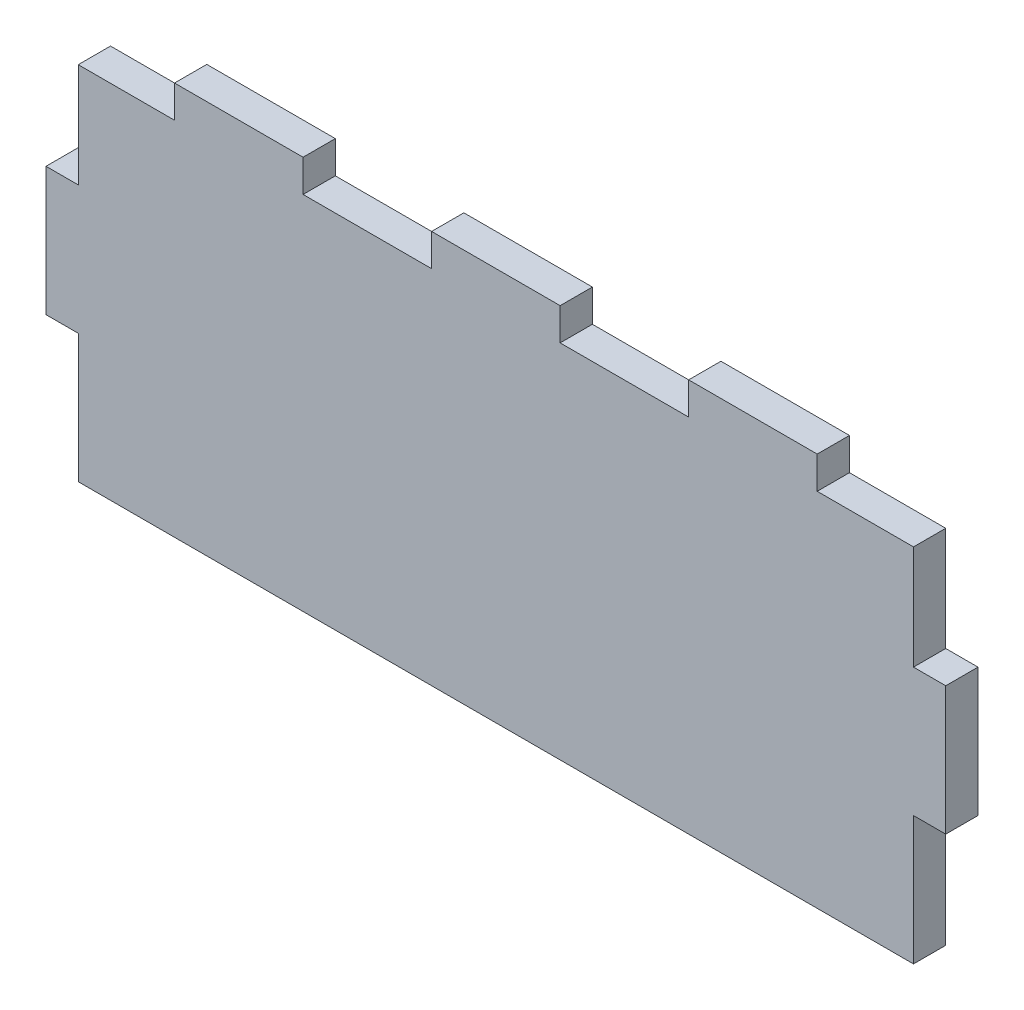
from build123d import *

# Parameters (mm, degrees)
BOSS_EXTRUDE1_DEPTH = 19


with BuildPart() as part:
    # Sketch1 → Boss-Extrude1 (new body)
    with BuildSketch(Plane.XY):
        Polygon((-213.084601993, 169.110299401), (-213.084601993, 150.110299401), (-269.798887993, 150.110299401), (-269.798887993, 88.778871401), (-288.798887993, 88.778871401), (-288.798887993, 13.064585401), (-269.798887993, 13.064585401), (-269.798887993, -62.649700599), (222.201114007, -62.649700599), (222.201114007, 13.064585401), (241.201114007, 13.064585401), (241.201114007, 88.778871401), (222.201114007, 88.778871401), (222.201114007, 150.110299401), (165.486828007, 150.110299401), (165.486828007, 169.110299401), (89.772542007, 169.110299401), (89.772542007, 150.110299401), (14.058256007, 150.110299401), (14.058256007, 169.110299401), (-61.656029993, 169.110299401), (-61.656029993, 150.110299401), (-137.370315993, 150.110299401), (-137.370315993, 169.110299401), align=None)
    extrude(amount=BOSS_EXTRUDE1_DEPTH)


solid = part.part
